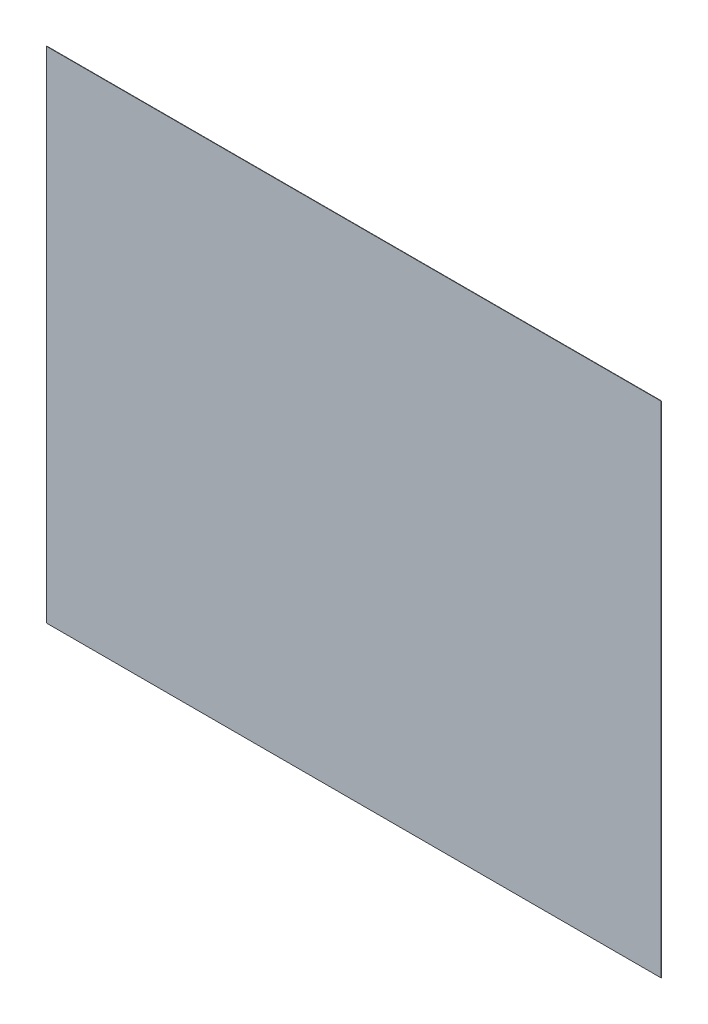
ISO-10303-21;
HEADER;
FILE_DESCRIPTION(('STEP AP214'),'2;1');
FILE_NAME('part.step','',(''),(''),'','','');
FILE_SCHEMA(('AUTOMOTIVE_DESIGN { 1 0 10303 214 1 1 1 1 }'));
ENDSEC;
DATA;
#1=APPLICATION_CONTEXT('core data for automotive mechanical design processes');
#2=APPLICATION_PROTOCOL_DEFINITION('international standard','automotive_design',2000,#1);
#3=PRODUCT_CONTEXT('',#1,'mechanical');
#4=PRODUCT('Part','Part','',(#3));
#5=PRODUCT_RELATED_PRODUCT_CATEGORY('part','',(#4));
#6=PRODUCT_DEFINITION_FORMATION('','',#4);
#7=PRODUCT_DEFINITION_CONTEXT('part definition',#1,'design');
#8=PRODUCT_DEFINITION('design','',#6,#7);
#9=PRODUCT_DEFINITION_SHAPE('','',#8);
#10=(LENGTH_UNIT() NAMED_UNIT(*) SI_UNIT(.MILLI.,.METRE.));
#11=(NAMED_UNIT(*) PLANE_ANGLE_UNIT() SI_UNIT($,.RADIAN.));
#12=(NAMED_UNIT(*) SI_UNIT($,.STERADIAN.) SOLID_ANGLE_UNIT());
#13=UNCERTAINTY_MEASURE_WITH_UNIT(LENGTH_MEASURE(1.E-05),#10,'distance_accuracy_value','');
#14=(GEOMETRIC_REPRESENTATION_CONTEXT(3) GLOBAL_UNCERTAINTY_ASSIGNED_CONTEXT((#13)) GLOBAL_UNIT_ASSIGNED_CONTEXT((#10,
#11,#12)) REPRESENTATION_CONTEXT('',''));
#15=CARTESIAN_POINT('',(0.,0.,0.));
#16=DIRECTION('',(0.,0.,1.));
#17=DIRECTION('',(1.,0.,0.));
#18=AXIS2_PLACEMENT_3D('',#15,#16,#17);
#19=CARTESIAN_POINT('',(800.,-650.,1.));
#20=DIRECTION('',(-1.,0.,0.));
#21=DIRECTION('',(0.,0.,1.));
#22=AXIS2_PLACEMENT_3D('',#19,#20,#21);
#23=PLANE('',#22);
#24=DIRECTION('',(0.,1.,0.));
#25=VECTOR('',#24,1.);
#26=CARTESIAN_POINT('',(800.,-650.,0.));
#27=LINE('',#26,#25);
#28=CARTESIAN_POINT('',(800.,-650.,0.));
#29=VERTEX_POINT('',#28);
#30=CARTESIAN_POINT('',(800.,650.,0.));
#31=VERTEX_POINT('',#30);
#32=EDGE_CURVE('E101',#29,#31,#27,.T.);
#33=ORIENTED_EDGE('',*,*,#32,.T.);
#34=DIRECTION('',(0.,0.,-1.));
#35=VECTOR('',#34,1.);
#36=CARTESIAN_POINT('',(800.,650.,1.));
#37=LINE('',#36,#35);
#38=CARTESIAN_POINT('',(800.,650.,1.));
#39=VERTEX_POINT('',#38);
#40=EDGE_CURVE('E11',#39,#31,#37,.T.);
#41=ORIENTED_EDGE('',*,*,#40,.F.);
#42=DIRECTION('',(0.,1.,0.));
#43=VECTOR('',#42,1.);
#44=CARTESIAN_POINT('',(800.,-650.,1.));
#45=LINE('',#44,#43);
#46=CARTESIAN_POINT('',(800.,-650.,1.));
#47=VERTEX_POINT('',#46);
#48=EDGE_CURVE('E89',#47,#39,#45,.T.);
#49=ORIENTED_EDGE('',*,*,#48,.F.);
#50=DIRECTION('',(0.,0.,-1.));
#51=VECTOR('',#50,1.);
#52=CARTESIAN_POINT('',(800.,-650.,1.));
#53=LINE('',#52,#51);
#54=EDGE_CURVE('E97',#47,#29,#53,.T.);
#55=ORIENTED_EDGE('',*,*,#54,.T.);
#56=EDGE_LOOP('',(#33,#41,#49,#55));
#57=FACE_BOUND('',#56,.T.);
#58=ADVANCED_FACE('F38',(#57),#23,.F.);
#59=CARTESIAN_POINT('',(-800.,650.,1.));
#60=DIRECTION('',(0.,-1.,0.));
#61=DIRECTION('',(0.,0.,-1.));
#62=AXIS2_PLACEMENT_3D('',#59,#60,#61);
#63=PLANE('',#62);
#64=DIRECTION('',(-1.,0.,0.));
#65=VECTOR('',#64,1.);
#66=CARTESIAN_POINT('',(-800.,650.,0.));
#67=LINE('',#66,#65);
#68=CARTESIAN_POINT('',(-800.,650.,0.));
#69=VERTEX_POINT('',#68);
#70=EDGE_CURVE('E93',#31,#69,#67,.T.);
#71=ORIENTED_EDGE('',*,*,#70,.T.);
#72=DIRECTION('',(0.,0.,-1.));
#73=VECTOR('',#72,1.);
#74=CARTESIAN_POINT('',(-800.,650.,1.));
#75=LINE('',#74,#73);
#76=CARTESIAN_POINT('',(-800.,650.,1.));
#77=VERTEX_POINT('',#76);
#78=EDGE_CURVE('E46',#77,#69,#75,.T.);
#79=ORIENTED_EDGE('',*,*,#78,.F.);
#80=DIRECTION('',(-1.,0.,0.));
#81=VECTOR('',#80,1.);
#82=CARTESIAN_POINT('',(-800.,650.,1.));
#83=LINE('',#82,#81);
#84=EDGE_CURVE('E84',#39,#77,#83,.T.);
#85=ORIENTED_EDGE('',*,*,#84,.F.);
#86=ORIENTED_EDGE('',*,*,#40,.T.);
#87=EDGE_LOOP('',(#71,#79,#85,#86));
#88=FACE_BOUND('',#87,.T.);
#89=ADVANCED_FACE('F92',(#88),#63,.F.);
#90=CARTESIAN_POINT('',(-800.,-650.,1.));
#91=DIRECTION('',(1.,0.,0.));
#92=DIRECTION('',(0.,0.,-1.));
#93=AXIS2_PLACEMENT_3D('',#90,#91,#92);
#94=PLANE('',#93);
#95=DIRECTION('',(0.,-1.,0.));
#96=VECTOR('',#95,1.);
#97=CARTESIAN_POINT('',(-800.,-650.,0.));
#98=LINE('',#97,#96);
#99=CARTESIAN_POINT('',(-800.,-650.,0.));
#100=VERTEX_POINT('',#99);
#101=EDGE_CURVE('E71',#69,#100,#98,.T.);
#102=ORIENTED_EDGE('',*,*,#101,.T.);
#103=DIRECTION('',(0.,0.,-1.));
#104=VECTOR('',#103,1.);
#105=CARTESIAN_POINT('',(-800.,-650.,1.));
#106=LINE('',#105,#104);
#107=CARTESIAN_POINT('',(-800.,-650.,1.));
#108=VERTEX_POINT('',#107);
#109=EDGE_CURVE('E94',#108,#100,#106,.T.);
#110=ORIENTED_EDGE('',*,*,#109,.F.);
#111=DIRECTION('',(0.,-1.,0.));
#112=VECTOR('',#111,1.);
#113=CARTESIAN_POINT('',(-800.,-650.,1.));
#114=LINE('',#113,#112);
#115=EDGE_CURVE('E87',#77,#108,#114,.T.);
#116=ORIENTED_EDGE('',*,*,#115,.F.);
#117=ORIENTED_EDGE('',*,*,#78,.T.);
#118=EDGE_LOOP('',(#102,#110,#116,#117));
#119=FACE_BOUND('',#118,.T.);
#120=ADVANCED_FACE('F95',(#119),#94,.F.);
#121=CARTESIAN_POINT('',(-800.,-650.,1.));
#122=DIRECTION('',(0.,1.,0.));
#123=DIRECTION('',(0.,0.,1.));
#124=AXIS2_PLACEMENT_3D('',#121,#122,#123);
#125=PLANE('',#124);
#126=DIRECTION('',(1.,0.,0.));
#127=VECTOR('',#126,1.);
#128=CARTESIAN_POINT('',(-800.,-650.,0.));
#129=LINE('',#128,#127);
#130=EDGE_CURVE('E77',#100,#29,#129,.T.);
#131=ORIENTED_EDGE('',*,*,#130,.T.);
#132=ORIENTED_EDGE('',*,*,#54,.F.);
#133=DIRECTION('',(1.,0.,0.));
#134=VECTOR('',#133,1.);
#135=CARTESIAN_POINT('',(-800.,-650.,1.));
#136=LINE('',#135,#134);
#137=EDGE_CURVE('E54',#108,#47,#136,.T.);
#138=ORIENTED_EDGE('',*,*,#137,.F.);
#139=ORIENTED_EDGE('',*,*,#109,.T.);
#140=EDGE_LOOP('',(#131,#132,#138,#139));
#141=FACE_BOUND('',#140,.T.);
#142=ADVANCED_FACE('F108',(#141),#125,.F.);
#143=CARTESIAN_POINT('',(0.,0.,1.));
#144=DIRECTION('',(0.,0.,-1.));
#145=DIRECTION('',(-1.,0.,0.));
#146=AXIS2_PLACEMENT_3D('',#143,#144,#145);
#147=PLANE('',#146);
#148=ORIENTED_EDGE('',*,*,#48,.T.);
#149=ORIENTED_EDGE('',*,*,#84,.T.);
#150=ORIENTED_EDGE('',*,*,#115,.T.);
#151=ORIENTED_EDGE('',*,*,#137,.T.);
#152=EDGE_LOOP('',(#148,#149,#150,#151));
#153=FACE_BOUND('',#152,.T.);
#154=ADVANCED_FACE('F85',(#153),#147,.F.);
#155=CARTESIAN_POINT('',(0.,0.,0.));
#156=DIRECTION('',(0.,0.,-1.));
#157=DIRECTION('',(-1.,0.,0.));
#158=AXIS2_PLACEMENT_3D('',#155,#156,#157);
#159=PLANE('',#158);
#160=ORIENTED_EDGE('',*,*,#32,.F.);
#161=ORIENTED_EDGE('',*,*,#130,.F.);
#162=ORIENTED_EDGE('',*,*,#101,.F.);
#163=ORIENTED_EDGE('',*,*,#70,.F.);
#164=EDGE_LOOP('',(#160,#161,#162,#163));
#165=FACE_BOUND('',#164,.T.);
#166=ADVANCED_FACE('F111',(#165),#159,.T.);
#167=CLOSED_SHELL('',(#58,#89,#120,#142,#154,#166));
#168=MANIFOLD_SOLID_BREP('B2',#167);
#169=ADVANCED_BREP_SHAPE_REPRESENTATION('',(#18,#168),#14);
#170=SHAPE_DEFINITION_REPRESENTATION(#9,#169);
ENDSEC;
END-ISO-10303-21;
